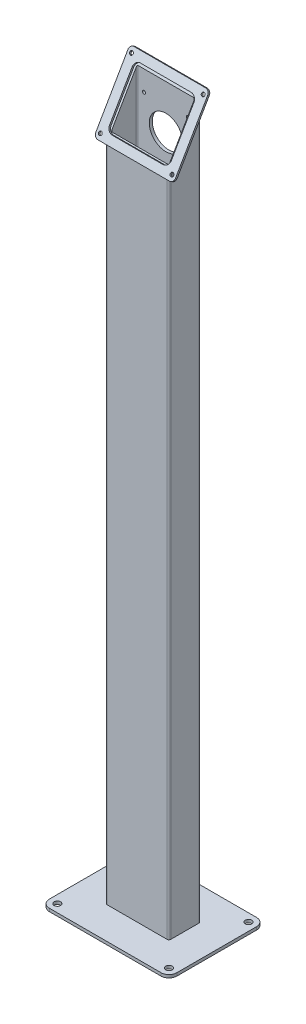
from build123d import *

# Parameters (mm, degrees)
BOSS_EXTRUDE1_DEPTH             = 4.7752
SKETCH2_R                       = 5.2
CUT_EXTRUDE2_DEPTH              = 128.089742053
SKETCH3_W                       = 101.6
SKETCH3_H                       = 50.8
BOSS_EXTRUDE2_DEPTH             = 1206.5
CUT_EXTRUDE3_DEPTH              = 1214.165796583
CUT_EXTRUDE3_DEPTH_BACK         = 1214.165796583
FILLET1_R                       = 3
SKETCH5_W                       = 92.0496
SKETCH5_H                       = 41.2496
CUT_EXTRUDE4_DEPTH              = 1158.180944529
FILLET2_R                       = 1.5
BOSS_EXTRUDE3_DEPTH             = 3
F_7_32_0_21875_DIAMETER_HOLE1_D = 5.55625
TAP_DRILL_FOR_1_4_20_TAP1_D     = 5.1054
TAP_DRILL_FOR_1_4_20_TAP1_DEPTH = 4.7752
CUT_EXTRUDE5_REACH              = 1169.528
SKETCH11_R                      = 26.543


with BuildPart() as part:
    # Sketch1 → Boss-Extrude1 (new body)
    with BuildSketch(Plane(origin=(0, 0, 0), x_dir=(1, 0, 0), z_dir=(0, 1, 0))):
        with BuildLine():
            Line((-88.9, 76.2), (88.9, 76.2))
            ThreePointArc((88.9, 76.2), (97.880256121, 72.480256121), (101.6, 63.5))
            Line((101.6, 63.5), (101.6, -63.5))
            ThreePointArc((101.6, -63.5), (97.880256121, -72.480256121), (88.9, -76.2))
            Line((88.9, -76.2), (-88.9, -76.2))
            ThreePointArc((-88.9, -76.2), (-97.880256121, -72.480256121), (-101.6, -63.5))
            Line((-101.6, -63.5), (-101.6, 63.5))
            ThreePointArc((-101.6, 63.5), (-97.880256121, 72.480256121), (-88.9, 76.2))
        make_face()
    extrude(amount=BOSS_EXTRUDE1_DEPTH)

    # Sketch2 → Cut-Extrude2 (cut, through all)
    with BuildSketch(Plane(origin=(0, 0, 0), x_dir=(1, 0, 0), z_dir=(0, 1, 0))):
        with Locations(Location((88.9, 63.5, 0), (0, 0, 270))):
            Circle(SKETCH2_R)
        with Locations(Location((88.9, -63.5, 0), (0, 0, 270))):
            Circle(SKETCH2_R)
        with Locations(Location((-88.9, -63.5, 0), (0, 0, 270))):
            Circle(SKETCH2_R)
        with Locations(Location((-88.9, 63.5, 0), (0, 0, 270))):
            Circle(SKETCH2_R)
    extrude(amount=CUT_EXTRUDE2_DEPTH, mode=Mode.SUBTRACT)

    # Sketch3 → Boss-Extrude2 (add)
    with BuildSketch(Plane(origin=(0, 0, 0), x_dir=(1, 0, 0), z_dir=(0, 1, 0))):
        Rectangle(SKETCH3_W, SKETCH3_H)
    extrude(amount=BOSS_EXTRUDE2_DEPTH)

    # Sketch4 → Cut-Extrude3 (cut, two sides: drawn at the far end of the back side and taken through both)
    with BuildSketch(Plane(origin=(0, 0, 0), x_dir=(0, 0, -1), z_dir=(1, 0, 0)).offset(-CUT_EXTRUDE3_DEPTH_BACK)):
        Polygon((25.4, 1150.19074), (-25.4, 1062.202558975), (-25.4, 1206.5), (25.4, 1206.5), align=None)
    extrude(amount=CUT_EXTRUDE3_DEPTH + CUT_EXTRUDE3_DEPTH_BACK, mode=Mode.SUBTRACT)

    # Fillet1
    fillet1_edges = [part.edges().sort_by_distance(p)[0] for p in [
        (50.8, 533.488879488, 25.4),
        (-50.8, 533.488879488, 25.4),
        (-50.8, 577.48297, -25.4),
        (50.8, 577.48297, -25.4),
    ]]
    fillet(fillet1_edges, radius=FILLET1_R)

    # Sketch5 → Cut-Extrude4 (cut, through all)
    with BuildSketch(Plane.XZ):
        Rectangle(SKETCH5_W, SKETCH5_H)
    extrude(amount=-CUT_EXTRUDE4_DEPTH, mode=Mode.SUBTRACT)

    # Fillet2
    fillet2_edges = [part.edges().sort_by_distance(p)[0] for p in [
        (-46.0248, 535.236723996, 20.6248),
        (46.0248, 535.236723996, 20.6248),
        (46.0248, 570.959925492, -20.6248),
        (-46.0248, 570.959925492, -20.6248),
    ]]
    fillet(fillet2_edges, radius=FILLET2_R)

    # Sketch6 → Boss-Extrude3 (add)
    with BuildSketch(Plane(origin=(0, 276.549162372, 478.997200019), x_dir=(1, 0, 0), z_dir=(0, 0.4999999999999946, 0.8660254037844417))):
        with BuildLine():
            Line((-57.15, 1016.833500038), (57.15, 1016.833500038))
            ThreePointArc((57.15, 1016.833500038), (61.640128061, 1014.973628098), (63.5, 1010.483500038))
            Line((63.5, 1010.483500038), (63.5, 907.829400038))
            ThreePointArc((63.5, 907.829400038), (61.640128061, 903.339271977), (57.15, 901.479400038))
            Line((57.15, 901.479400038), (-57.15, 901.479400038))
            ThreePointArc((-57.15, 901.479400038), (-61.640128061, 903.339271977), (-63.5, 907.829400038))
            Line((-63.5, 907.829400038), (-63.5, 1010.483500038))
            ThreePointArc((-63.5, 1010.483500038), (-61.640128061, 1014.973628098), (-57.15, 1016.833500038))
        make_face()
        with BuildLine():
            Line((-40.3225, 1003.856163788), (40.3225, 1003.856163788))
            ThreePointArc((40.3225, 1003.856163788), (46.608679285, 1001.252343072), (49.2125, 994.966163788))
            Line((49.2125, 994.966163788), (49.2125, 923.346736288))
            ThreePointArc((49.2125, 923.346736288), (46.608679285, 917.060557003), (40.3225, 914.456736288))
            Line((40.3225, 914.456736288), (-40.3225, 914.456736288))
            ThreePointArc((-40.3225, 914.456736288), (-46.608679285, 917.060557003), (-49.2125, 923.346736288))
            Line((-49.2125, 923.346736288), (-49.2125, 994.966163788))
            ThreePointArc((-49.2125, 994.966163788), (-46.608679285, 1001.252343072), (-40.3225, 1003.856163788))
        make_face(mode=Mode.SUBTRACT)
    extrude(amount=BOSS_EXTRUDE3_DEPTH)

    # 7_32 _0.21875_ Diameter Hole1 (through all)
    with Locations(Plane(origin=(0, 278.049162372, 481.59527623), x_dir=(1, 0, 0), z_dir=(0, 0.4999999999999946, 0.8660254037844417))):
        with Locations((-57.15, 1008.813450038), (57.15, 1008.813450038), (57.15, 909.499450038), (-57.15, 909.499450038)):
            Hole(F_7_32_0_21875_DIAMETER_HOLE1_D / 2)

    # Tap Drill for 1_4-20 Tap1
    with Locations(Plane(origin=(0, 0, -25.4), x_dir=(-1, 0, 0), z_dir=(0, 0, -1))):
        with Locations((-34.925, 1109.6752), (34.925, 1109.6752), (34.925, 792.1752), (-34.925, 792.1752), (-34.925, 658.8252), (34.925, 658.8252), (34.925, 207.9752), (-34.925, 207.9752)):
            Hole(TAP_DRILL_FOR_1_4_20_TAP1_D / 2, depth=TAP_DRILL_FOR_1_4_20_TAP1_DEPTH)

    # Sketch11 → Cut-Extrude5 (cut, up to next)
    with BuildSketch(Plane(origin=(0, 0, -25.4), x_dir=(-1, 0, 0), z_dir=(0, 0, -1)), mode=Mode.PRIVATE) as cut_extrude5_sk1:
        with Locations((0, 1071.5752)):
            Circle(SKETCH11_R)
    cut_extrude5_tool1 = extrude(cut_extrude5_sk1.sketch, amount=-CUT_EXTRUDE5_REACH, mode=Mode.PRIVATE) & part.part
    add(cut_extrude5_tool1.solids().sort_by_distance((0, 1071.5752, -25.4))[0], mode=Mode.SUBTRACT)


solid = part.part
